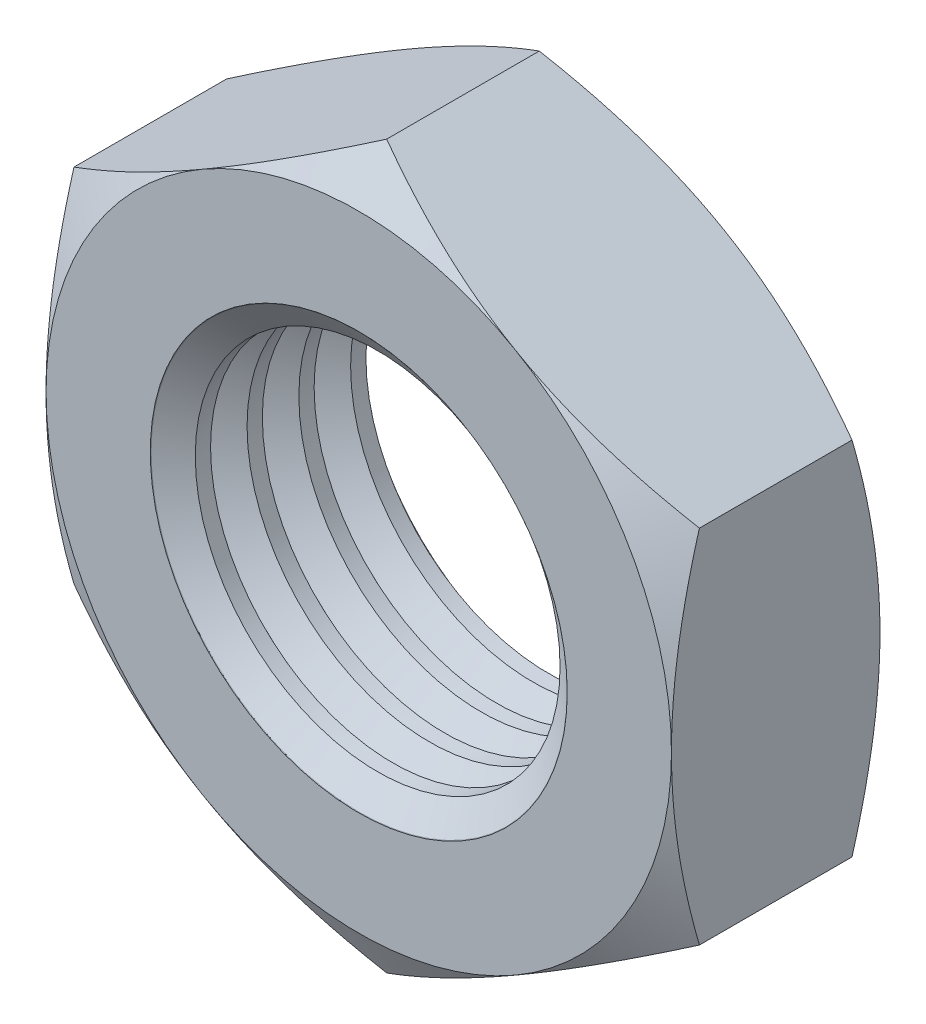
ISO-10303-21;
HEADER;
FILE_DESCRIPTION(('STEP AP214'),'2;1');
FILE_NAME('part.step','',(''),(''),'','','');
FILE_SCHEMA(('AUTOMOTIVE_DESIGN { 1 0 10303 214 1 1 1 1 }'));
ENDSEC;
DATA;
#1=APPLICATION_CONTEXT('core data for automotive mechanical design processes');
#2=APPLICATION_PROTOCOL_DEFINITION('international standard','automotive_design',2000,#1);
#3=PRODUCT_CONTEXT('',#1,'mechanical');
#4=PRODUCT('Part','Part','',(#3));
#5=PRODUCT_RELATED_PRODUCT_CATEGORY('part','',(#4));
#6=PRODUCT_DEFINITION_FORMATION('','',#4);
#7=PRODUCT_DEFINITION_CONTEXT('part definition',#1,'design');
#8=PRODUCT_DEFINITION('design','',#6,#7);
#9=PRODUCT_DEFINITION_SHAPE('','',#8);
#10=(LENGTH_UNIT() NAMED_UNIT(*) SI_UNIT(.MILLI.,.METRE.));
#11=(NAMED_UNIT(*) PLANE_ANGLE_UNIT() SI_UNIT($,.RADIAN.));
#12=(NAMED_UNIT(*) SI_UNIT($,.STERADIAN.) SOLID_ANGLE_UNIT());
#13=UNCERTAINTY_MEASURE_WITH_UNIT(LENGTH_MEASURE(1.E-05),#10,'distance_accuracy_value','');
#14=(GEOMETRIC_REPRESENTATION_CONTEXT(3) GLOBAL_UNCERTAINTY_ASSIGNED_CONTEXT((#13)) GLOBAL_UNIT_ASSIGNED_CONTEXT((#10,
#11,#12)) REPRESENTATION_CONTEXT('',''));
#15=CARTESIAN_POINT('',(0.,0.,0.));
#16=DIRECTION('',(0.,0.,1.));
#17=DIRECTION('',(1.,0.,0.));
#18=AXIS2_PLACEMENT_3D('',#15,#16,#17);
#19=CARTESIAN_POINT('',(0.,0.,-8.));
#20=DIRECTION('',(0.,0.,1.));
#21=DIRECTION('',(1.,0.,0.));
#22=AXIS2_PLACEMENT_3D('',#19,#20,#21);
#23=CYLINDRICAL_SURFACE('',#22,7.);
#24=CARTESIAN_POINT('',(0.,0.,-6.68750753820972));
#25=DIRECTION('',(0.,0.,-1.));
#26=DIRECTION('',(-1.,0.,0.));
#27=AXIS2_PLACEMENT_3D('',#24,#25,#26);
#28=CIRCLE('',#27,7.);
#29=CARTESIAN_POINT('',(-7.,0.,-6.68750753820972));
#30=VERTEX_POINT('',#29);
#31=EDGE_CURVE('E343',#30,#30,#28,.T.);
#32=ORIENTED_EDGE('',*,*,#31,.F.);
#33=EDGE_LOOP('',(#32));
#34=FACE_BOUND('',#33,.T.);
#35=CARTESIAN_POINT('',(0.,0.,-7.27439246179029));
#36=DIRECTION('',(0.,0.,-1.));
#37=DIRECTION('',(-1.,0.,0.));
#38=AXIS2_PLACEMENT_3D('',#35,#36,#37);
#39=CIRCLE('',#38,7.);
#40=CARTESIAN_POINT('',(-7.,0.,-7.27439246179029));
#41=VERTEX_POINT('',#40);
#42=EDGE_CURVE('E173',#41,#41,#39,.F.);
#43=ORIENTED_EDGE('',*,*,#42,.F.);
#44=EDGE_LOOP('',(#43));
#45=FACE_BOUND('',#44,.T.);
#46=ADVANCED_FACE('F31',(#34,#45),#23,.F.);
#47=CARTESIAN_POINT('',(0.,0.,-5.2870924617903));
#48=DIRECTION('',(0.,0.,-1.));
#49=DIRECTION('',(-1.,0.,0.));
#50=AXIS2_PLACEMENT_3D('',#47,#48,#49);
#51=CIRCLE('',#50,7.);
#52=CARTESIAN_POINT('',(-7.,0.,-5.2870924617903));
#53=VERTEX_POINT('',#52);
#54=EDGE_CURVE('E346',#53,#53,#51,.T.);
#55=ORIENTED_EDGE('',*,*,#54,.T.);
#56=EDGE_LOOP('',(#55));
#57=FACE_BOUND('',#56,.T.);
#58=CARTESIAN_POINT('',(0.,0.,-4.70020753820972));
#59=DIRECTION('',(0.,0.,-1.));
#60=DIRECTION('',(-1.,0.,0.));
#61=AXIS2_PLACEMENT_3D('',#58,#59,#60);
#62=CIRCLE('',#61,7.);
#63=CARTESIAN_POINT('',(-7.,0.,-4.70020753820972));
#64=VERTEX_POINT('',#63);
#65=EDGE_CURVE('E334',#64,#64,#62,.T.);
#66=ORIENTED_EDGE('',*,*,#65,.F.);
#67=EDGE_LOOP('',(#66));
#68=FACE_BOUND('',#67,.T.);
#69=ADVANCED_FACE('F293',(#57,#68),#23,.F.);
#70=CARTESIAN_POINT('',(0.,0.,-3.2997924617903));
#71=DIRECTION('',(0.,0.,-1.));
#72=DIRECTION('',(-1.,0.,0.));
#73=AXIS2_PLACEMENT_3D('',#70,#71,#72);
#74=CIRCLE('',#73,7.);
#75=CARTESIAN_POINT('',(-7.,0.,-3.2997924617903));
#76=VERTEX_POINT('',#75);
#77=EDGE_CURVE('E337',#76,#76,#74,.T.);
#78=ORIENTED_EDGE('',*,*,#77,.T.);
#79=EDGE_LOOP('',(#78));
#80=FACE_BOUND('',#79,.T.);
#81=CARTESIAN_POINT('',(0.,0.,-2.71290753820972));
#82=DIRECTION('',(0.,0.,-1.));
#83=DIRECTION('',(-1.,0.,0.));
#84=AXIS2_PLACEMENT_3D('',#81,#82,#83);
#85=CIRCLE('',#84,7.);
#86=CARTESIAN_POINT('',(-7.,0.,-2.71290753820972));
#87=VERTEX_POINT('',#86);
#88=EDGE_CURVE('E325',#87,#87,#85,.T.);
#89=ORIENTED_EDGE('',*,*,#88,.F.);
#90=EDGE_LOOP('',(#89));
#91=FACE_BOUND('',#90,.T.);
#92=ADVANCED_FACE('F299',(#80,#91),#23,.F.);
#93=CARTESIAN_POINT('',(0.,0.,-1.3124924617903));
#94=DIRECTION('',(0.,0.,-1.));
#95=DIRECTION('',(-1.,0.,0.));
#96=AXIS2_PLACEMENT_3D('',#93,#94,#95);
#97=CIRCLE('',#96,7.);
#98=CARTESIAN_POINT('',(-7.,0.,-1.3124924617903));
#99=VERTEX_POINT('',#98);
#100=EDGE_CURVE('E315',#99,#99,#97,.T.);
#101=ORIENTED_EDGE('',*,*,#100,.T.);
#102=EDGE_LOOP('',(#101));
#103=FACE_BOUND('',#102,.T.);
#104=CARTESIAN_POINT('',(0.,0.,-0.725607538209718));
#105=DIRECTION('',(0.,0.,-1.));
#106=DIRECTION('',(-1.,0.,0.));
#107=AXIS2_PLACEMENT_3D('',#104,#105,#106);
#108=CIRCLE('',#107,7.);
#109=CARTESIAN_POINT('',(-7.,0.,-0.725607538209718));
#110=VERTEX_POINT('',#109);
#111=EDGE_CURVE('E318',#110,#110,#108,.T.);
#112=ORIENTED_EDGE('',*,*,#111,.F.);
#113=EDGE_LOOP('',(#112));
#114=FACE_BOUND('',#113,.T.);
#115=ADVANCED_FACE('F295',(#103,#114),#23,.F.);
#116=CARTESIAN_POINT('',(0.,13.856406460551,-8.));
#117=DIRECTION('',(0.,0.,-1.));
#118=DIRECTION('',(-1.,0.,0.));
#119=AXIS2_PLACEMENT_3D('',#116,#117,#118);
#120=PLANE('',#119);
#121=CARTESIAN_POINT('',(0.,0.,-8.));
#122=DIRECTION('',(0.,0.,-1.));
#123=DIRECTION('',(-1.,0.,0.));
#124=AXIS2_PLACEMENT_3D('',#121,#122,#123);
#125=CIRCLE('',#124,12.);
#126=CARTESIAN_POINT('',(-12.,0.,-8.));
#127=VERTEX_POINT('',#126);
#128=CARTESIAN_POINT('',(-6.00000000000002,-10.3923048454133,-8.));
#129=VERTEX_POINT('',#128);
#130=EDGE_CURVE('E167',#127,#129,#125,.F.);
#131=ORIENTED_EDGE('',*,*,#130,.F.);
#132=CARTESIAN_POINT('',(-6.00000000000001,10.3923048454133,-8.));
#133=VERTEX_POINT('',#132);
#134=EDGE_CURVE('E149',#133,#127,#125,.F.);
#135=ORIENTED_EDGE('',*,*,#134,.F.);
#136=CARTESIAN_POINT('',(6.00000000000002,10.3923048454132,-8.));
#137=VERTEX_POINT('',#136);
#138=EDGE_CURVE('E166',#137,#133,#125,.F.);
#139=ORIENTED_EDGE('',*,*,#138,.F.);
#140=CARTESIAN_POINT('',(0.,0.,-8.));
#141=DIRECTION('',(0.,0.,1.));
#142=DIRECTION('',(1.,0.,0.));
#143=AXIS2_PLACEMENT_3D('',#140,#141,#142);
#144=CIRCLE('',#143,12.);
#145=CARTESIAN_POINT('',(12.,0.,-8.));
#146=VERTEX_POINT('',#145);
#147=EDGE_CURVE('E240',#146,#137,#144,.T.);
#148=ORIENTED_EDGE('',*,*,#147,.F.);
#149=CARTESIAN_POINT('',(6.00000000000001,-10.3923048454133,-8.));
#150=VERTEX_POINT('',#149);
#151=EDGE_CURVE('E464',#150,#146,#125,.F.);
#152=ORIENTED_EDGE('',*,*,#151,.F.);
#153=EDGE_CURVE('E485',#129,#150,#125,.F.);
#154=ORIENTED_EDGE('',*,*,#153,.F.);
#155=EDGE_LOOP('',(#131,#135,#139,#148,#152,#154));
#156=FACE_BOUND('',#155,.T.);
#157=CARTESIAN_POINT('',(0.,0.,-8.));
#158=DIRECTION('',(0.,0.,-1.));
#159=DIRECTION('',(-1.,0.,0.));
#160=AXIS2_PLACEMENT_3D('',#157,#158,#159);
#161=CIRCLE('',#160,8.);
#162=CARTESIAN_POINT('',(-8.,0.,-8.));
#163=VERTEX_POINT('',#162);
#164=EDGE_CURVE('E171',#163,#163,#161,.F.);
#165=ORIENTED_EDGE('',*,*,#164,.T.);
#166=EDGE_LOOP('',(#165));
#167=FACE_BOUND('',#166,.T.);
#168=ADVANCED_FACE('F245',(#156,#167),#120,.T.);
#169=CARTESIAN_POINT('',(0.,13.856406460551,0.));
#170=DIRECTION('',(0.,0.,-1.));
#171=DIRECTION('',(-1.,0.,0.));
#172=AXIS2_PLACEMENT_3D('',#169,#170,#171);
#173=PLANE('',#172);
#174=CARTESIAN_POINT('',(0.,0.,0.));
#175=DIRECTION('',(0.,0.,-1.));
#176=DIRECTION('',(-1.,0.,0.));
#177=AXIS2_PLACEMENT_3D('',#174,#175,#176);
#178=CIRCLE('',#177,12.);
#179=CARTESIAN_POINT('',(-12.,0.,0.));
#180=VERTEX_POINT('',#179);
#181=CARTESIAN_POINT('',(-6.00000000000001,10.3923048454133,0.));
#182=VERTEX_POINT('',#181);
#183=EDGE_CURVE('E11',#180,#182,#178,.T.);
#184=ORIENTED_EDGE('',*,*,#183,.F.);
#185=CARTESIAN_POINT('',(-6.00000000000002,-10.3923048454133,0.));
#186=VERTEX_POINT('',#185);
#187=EDGE_CURVE('E43',#186,#180,#178,.T.);
#188=ORIENTED_EDGE('',*,*,#187,.F.);
#189=CARTESIAN_POINT('',(6.00000000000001,-10.3923048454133,0.));
#190=VERTEX_POINT('',#189);
#191=EDGE_CURVE('E170',#190,#186,#178,.T.);
#192=ORIENTED_EDGE('',*,*,#191,.F.);
#193=CARTESIAN_POINT('',(12.,0.,0.));
#194=VERTEX_POINT('',#193);
#195=EDGE_CURVE('E422',#194,#190,#178,.T.);
#196=ORIENTED_EDGE('',*,*,#195,.F.);
#197=CARTESIAN_POINT('',(0.,0.,0.));
#198=DIRECTION('',(0.,0.,1.));
#199=DIRECTION('',(1.,0.,0.));
#200=AXIS2_PLACEMENT_3D('',#197,#198,#199);
#201=CIRCLE('',#200,12.);
#202=CARTESIAN_POINT('',(6.00000000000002,10.3923048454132,0.));
#203=VERTEX_POINT('',#202);
#204=EDGE_CURVE('E125',#194,#203,#201,.T.);
#205=ORIENTED_EDGE('',*,*,#204,.T.);
#206=EDGE_CURVE('E41',#182,#203,#178,.T.);
#207=ORIENTED_EDGE('',*,*,#206,.F.);
#208=EDGE_LOOP('',(#184,#188,#192,#196,#205,#207));
#209=FACE_BOUND('',#208,.T.);
#210=CARTESIAN_POINT('',(0.,0.,0.));
#211=DIRECTION('',(0.,0.,1.));
#212=DIRECTION('',(1.,0.,0.));
#213=AXIS2_PLACEMENT_3D('',#210,#211,#212);
#214=CIRCLE('',#213,8.);
#215=CARTESIAN_POINT('',(8.,0.,0.));
#216=VERTEX_POINT('',#215);
#217=EDGE_CURVE('E176',#216,#216,#214,.T.);
#218=ORIENTED_EDGE('',*,*,#217,.F.);
#219=EDGE_LOOP('',(#218));
#220=FACE_BOUND('',#219,.T.);
#221=ADVANCED_FACE('F309',(#209,#220),#173,.F.);
#222=CARTESIAN_POINT('',(0.,13.856406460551,-8.));
#223=DIRECTION('',(-0.500000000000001,0.866025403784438,0.));
#224=DIRECTION('',(-0.866025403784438,-0.500000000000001,0.));
#225=AXIS2_PLACEMENT_3D('',#222,#223,#224);
#226=PLANE('',#225);
#227=DIRECTION('',(0.,0.,1.));
#228=VECTOR('',#227,1.);
#229=CARTESIAN_POINT('',(-12.,6.9282032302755,-8.));
#230=LINE('',#229,#228);
#231=CARTESIAN_POINT('',(-12.,6.92820323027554,-6.9282032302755));
#232=VERTEX_POINT('',#231);
#233=CARTESIAN_POINT('',(-12.,6.9282032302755,-1.07179676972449));
#234=VERTEX_POINT('',#233);
#235=EDGE_CURVE('E161',#232,#234,#230,.T.);
#236=ORIENTED_EDGE('',*,*,#235,.T.);
#237=CARTESIAN_POINT('',(-12.0002,6.92808776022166,-1.07186343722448));
#238=CARTESIAN_POINT('',(-11.7364142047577,7.08038456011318,-0.983949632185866));
#239=CARTESIAN_POINT('',(-11.4716448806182,7.2332492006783,-0.900025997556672));
#240=CARTESIAN_POINT('',(-10.9399829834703,7.54020434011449,-0.741266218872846));
#241=CARTESIAN_POINT('',(-10.6730897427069,7.69429522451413,-0.666433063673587));
#242=CARTESIAN_POINT('',(-9.86810959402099,8.15905073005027,-0.457017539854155));
#243=CARTESIAN_POINT('',(-9.3268449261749,8.47155003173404,-0.337903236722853));
#244=CARTESIAN_POINT('',(-8.51686717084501,8.93919090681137,-0.198231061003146));
#245=CARTESIAN_POINT('',(-8.25057389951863,9.09293539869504,-0.158443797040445));
#246=CARTESIAN_POINT('',(-7.71675440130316,9.40113622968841,-0.0917233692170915));
#247=CARTESIAN_POINT('',(-7.44922815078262,9.55559258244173,-0.0647904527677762));
#248=CARTESIAN_POINT('',(-6.91372963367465,9.86476279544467,-0.0244685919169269));
#249=CARTESIAN_POINT('',(-6.64575827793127,10.0194761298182,-0.011063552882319));
#250=CARTESIAN_POINT('',(-6.10956726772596,10.3290461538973,0.00191690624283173));
#251=CARTESIAN_POINT('',(-5.84134762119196,10.4839028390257,0.00149275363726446));
#252=CARTESIAN_POINT('',(-5.3399106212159,10.7734076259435,-0.012220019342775));
#253=CARTESIAN_POINT('',(-5.10665750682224,10.908076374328,-0.0238359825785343));
#254=CARTESIAN_POINT('',(-4.64068775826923,11.1771041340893,-0.0573080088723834));
#255=CARTESIAN_POINT('',(-4.40797116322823,11.3114631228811,-0.0791647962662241));
#256=CARTESIAN_POINT('',(-3.94320092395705,11.5797983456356,-0.132737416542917));
#257=CARTESIAN_POINT('',(-3.71114798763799,11.7137741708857,-0.164461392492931));
#258=CARTESIAN_POINT('',(-3.24813003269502,11.9810977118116,-0.237211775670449));
#259=CARTESIAN_POINT('',(-3.01716508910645,12.1144453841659,-0.278238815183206));
#260=CARTESIAN_POINT('',(-2.31605804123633,12.5192297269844,-0.416311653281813));
#261=CARTESIAN_POINT('',(-1.84794625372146,12.789494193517,-0.527124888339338));
#262=CARTESIAN_POINT('',(-0.918702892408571,13.3259930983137,-0.778625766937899));
#263=CARTESIAN_POINT('',(-0.457559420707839,13.5922344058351,-0.9192543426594));
#264=CARTESIAN_POINT('',(0.000200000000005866,13.8565219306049,-1.07186343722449));
#265=B_SPLINE_CURVE_WITH_KNOTS('',3,(#237,#238,#239,#240,#241,#242,#243,#244,#245,#246,#247,
#248,#249,#250,#251,#252,#253,#254,#255,#256,#257,#258,#259,#260,#261,#262,#263,#264),
.UNSPECIFIED.,.F.,.F.,(4,2,2,2,2,2,2,2,2,2,2,2,2,4),(0.,0.951004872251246,1.90232158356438,
3.80900466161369,4.73894551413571,5.6689042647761,6.59775529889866,7.52657763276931,
8.3351464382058,9.1437724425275,9.95306755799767,10.7624176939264,12.4167102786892,
14.0677556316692),.UNSPECIFIED.);
#266=EDGE_CURVE('E130',#234,#182,#265,.T.);
#267=ORIENTED_EDGE('',*,*,#266,.T.);
#268=CARTESIAN_POINT('',(0.,13.856406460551,-1.0717967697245));
#269=VERTEX_POINT('',#268);
#270=EDGE_CURVE('E50',#182,#269,#265,.T.);
#271=ORIENTED_EDGE('',*,*,#270,.T.);
#272=DIRECTION('',(0.,0.,1.));
#273=VECTOR('',#272,1.);
#274=CARTESIAN_POINT('',(0.,13.856406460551,-8.));
#275=LINE('',#274,#273);
#276=CARTESIAN_POINT('',(0.,13.856406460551,-6.9282032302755));
#277=VERTEX_POINT('',#276);
#278=EDGE_CURVE('E146',#277,#269,#275,.T.);
#279=ORIENTED_EDGE('',*,*,#278,.F.);
#280=CARTESIAN_POINT('',(-12.0002,6.92808776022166,-6.92813656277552));
#281=CARTESIAN_POINT('',(-11.7364142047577,7.08038456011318,-7.01605036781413));
#282=CARTESIAN_POINT('',(-11.4716448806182,7.2332492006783,-7.09997400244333));
#283=CARTESIAN_POINT('',(-10.9399829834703,7.54020434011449,-7.25873378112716));
#284=CARTESIAN_POINT('',(-10.6730897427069,7.69429522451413,-7.33356693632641));
#285=CARTESIAN_POINT('',(-9.86810959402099,8.15905073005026,-7.54298246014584));
#286=CARTESIAN_POINT('',(-9.3268449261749,8.47155003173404,-7.66209676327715));
#287=CARTESIAN_POINT('',(-8.51686717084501,8.93919090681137,-7.80176893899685));
#288=CARTESIAN_POINT('',(-8.25057389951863,9.09293539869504,-7.84155620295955));
#289=CARTESIAN_POINT('',(-7.71675440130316,9.40113622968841,-7.90827663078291));
#290=CARTESIAN_POINT('',(-7.44922815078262,9.55559258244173,-7.93520954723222));
#291=CARTESIAN_POINT('',(-6.91372963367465,9.86476279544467,-7.97553140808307));
#292=CARTESIAN_POINT('',(-6.64575827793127,10.0194761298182,-7.98893644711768));
#293=CARTESIAN_POINT('',(-6.10956726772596,10.3290461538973,-8.00191690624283));
#294=CARTESIAN_POINT('',(-5.84134762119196,10.4839028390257,-8.00149275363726));
#295=CARTESIAN_POINT('',(-5.33991062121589,10.7734076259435,-7.98777998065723));
#296=CARTESIAN_POINT('',(-5.10665750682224,10.908076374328,-7.97616401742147));
#297=CARTESIAN_POINT('',(-4.64068775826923,11.1771041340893,-7.94269199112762));
#298=CARTESIAN_POINT('',(-4.40797116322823,11.3114631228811,-7.92083520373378));
#299=CARTESIAN_POINT('',(-3.94320092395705,11.5797983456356,-7.86726258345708));
#300=CARTESIAN_POINT('',(-3.71114798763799,11.7137741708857,-7.83553860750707));
#301=CARTESIAN_POINT('',(-3.24813003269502,11.9810977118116,-7.76278822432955));
#302=CARTESIAN_POINT('',(-3.01716508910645,12.1144453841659,-7.72176118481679));
#303=CARTESIAN_POINT('',(-2.31605804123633,12.5192297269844,-7.58368834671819));
#304=CARTESIAN_POINT('',(-1.84794625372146,12.789494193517,-7.47287511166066));
#305=CARTESIAN_POINT('',(-0.918702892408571,13.3259930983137,-7.2213742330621));
#306=CARTESIAN_POINT('',(-0.457559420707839,13.5922344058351,-7.0807456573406));
#307=CARTESIAN_POINT('',(0.000200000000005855,13.8565219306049,-6.92813656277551));
#308=B_SPLINE_CURVE_WITH_KNOTS('',3,(#280,#281,#282,#283,#284,#285,#286,#287,#288,#289,#290,
#291,#292,#293,#294,#295,#296,#297,#298,#299,#300,#301,#302,#303,#304,#305,#306,#307),
.UNSPECIFIED.,.F.,.F.,(4,2,2,2,2,2,2,2,2,2,2,2,2,4),(0.,0.951004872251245,1.90232158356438,
3.80900466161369,4.7389455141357,5.6689042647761,6.59775529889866,7.52657763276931,
8.3351464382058,9.1437724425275,9.95306755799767,10.7624176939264,12.4167102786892,
14.0677556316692),.UNSPECIFIED.);
#309=EDGE_CURVE('E164',#133,#277,#308,.T.);
#310=ORIENTED_EDGE('',*,*,#309,.F.);
#311=EDGE_CURVE('E255',#232,#133,#308,.T.);
#312=ORIENTED_EDGE('',*,*,#311,.F.);
#313=EDGE_LOOP('',(#236,#267,#271,#279,#310,#312));
#314=FACE_BOUND('',#313,.T.);
#315=ADVANCED_FACE('F33',(#314),#226,.T.);
#316=CARTESIAN_POINT('',(12.,6.92820323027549,-8.));
#317=DIRECTION('',(0.500000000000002,0.866025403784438,0.));
#318=DIRECTION('',(-0.866025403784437,0.500000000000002,0.));
#319=AXIS2_PLACEMENT_3D('',#316,#317,#318);
#320=PLANE('',#319);
#321=ORIENTED_EDGE('',*,*,#278,.T.);
#322=CARTESIAN_POINT('',(-0.000199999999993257,13.8565219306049,-1.07186343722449));
#323=CARTESIAN_POINT('',(0.263585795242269,13.7042251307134,-0.983949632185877));
#324=CARTESIAN_POINT('',(0.528355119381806,13.5513604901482,-0.900025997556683));
#325=CARTESIAN_POINT('',(1.06001701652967,13.244405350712,-0.741266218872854));
#326=CARTESIAN_POINT('',(1.32691025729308,13.0903144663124,-0.666433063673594));
#327=CARTESIAN_POINT('',(2.13189040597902,12.6255589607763,-0.45701753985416));
#328=CARTESIAN_POINT('',(2.67315507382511,12.3130596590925,-0.337903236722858));
#329=CARTESIAN_POINT('',(3.48313282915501,11.8454187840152,-0.19823106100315));
#330=CARTESIAN_POINT('',(3.74942610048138,11.6916742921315,-0.158443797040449));
#331=CARTESIAN_POINT('',(4.28324559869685,11.3834734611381,-0.0917233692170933));
#332=CARTESIAN_POINT('',(4.55077184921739,11.2290171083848,-0.0647904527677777));
#333=CARTESIAN_POINT('',(5.08627036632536,10.9198468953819,-0.0244685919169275));
#334=CARTESIAN_POINT('',(5.35424172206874,10.7651335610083,-0.011063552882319));
#335=CARTESIAN_POINT('',(5.89043273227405,10.4555635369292,0.00191690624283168));
#336=CARTESIAN_POINT('',(6.15865237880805,10.3007068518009,0.00149275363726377));
#337=CARTESIAN_POINT('',(6.66008937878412,10.011202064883,-0.0122200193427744));
#338=CARTESIAN_POINT('',(6.89334249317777,9.87653331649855,-0.0238359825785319));
#339=CARTESIAN_POINT('',(7.35931224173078,9.60750555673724,-0.0573080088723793));
#340=CARTESIAN_POINT('',(7.59202883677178,9.47314656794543,-0.0791647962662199));
#341=CARTESIAN_POINT('',(8.05679907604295,9.20481134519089,-0.132737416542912));
#342=CARTESIAN_POINT('',(8.28885201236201,9.07083551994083,-0.164461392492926));
#343=CARTESIAN_POINT('',(8.75186996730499,8.80351197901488,-0.237211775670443));
#344=CARTESIAN_POINT('',(8.98283491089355,8.67016430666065,-0.278238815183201));
#345=CARTESIAN_POINT('',(9.68394195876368,8.26537996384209,-0.416311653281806));
#346=CARTESIAN_POINT('',(10.1520537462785,7.99511549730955,-0.52712488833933));
#347=CARTESIAN_POINT('',(11.0812971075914,7.45861659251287,-0.778625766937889));
#348=CARTESIAN_POINT('',(11.5424405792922,7.19237528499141,-0.919254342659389));
#349=CARTESIAN_POINT('',(12.0002,6.92808776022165,-1.07186343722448));
#350=B_SPLINE_CURVE_WITH_KNOTS('',3,(#322,#323,#324,#325,#326,#327,#328,#329,#330,#331,#332,
#333,#334,#335,#336,#337,#338,#339,#340,#341,#342,#343,#344,#345,#346,#347,#348,#349),
.UNSPECIFIED.,.F.,.F.,(4,2,2,2,2,2,2,2,2,2,2,2,2,4),(0.,0.951004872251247,1.90232158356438,
3.8090046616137,4.73894551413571,5.66890426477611,6.59775529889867,7.52657763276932,
8.3351464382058,9.14377244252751,9.95306755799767,10.7624176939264,12.4167102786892,
14.0677556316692),.UNSPECIFIED.);
#351=EDGE_CURVE('E140',#269,#203,#350,.T.);
#352=ORIENTED_EDGE('',*,*,#351,.T.);
#353=CARTESIAN_POINT('',(12.,6.92820323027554,-1.0717967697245));
#354=VERTEX_POINT('',#353);
#355=EDGE_CURVE('E57',#203,#354,#350,.T.);
#356=ORIENTED_EDGE('',*,*,#355,.T.);
#357=DIRECTION('',(0.,0.,1.));
#358=VECTOR('',#357,1.);
#359=CARTESIAN_POINT('',(12.,6.92820323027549,-8.));
#360=LINE('',#359,#358);
#361=CARTESIAN_POINT('',(12.,6.92820323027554,-6.9282032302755));
#362=VERTEX_POINT('',#361);
#363=EDGE_CURVE('E139',#362,#354,#360,.T.);
#364=ORIENTED_EDGE('',*,*,#363,.F.);
#365=CARTESIAN_POINT('',(-0.000199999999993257,13.8565219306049,-6.92813656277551));
#366=CARTESIAN_POINT('',(0.263585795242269,13.7042251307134,-7.01605036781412));
#367=CARTESIAN_POINT('',(0.528355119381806,13.5513604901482,-7.09997400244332));
#368=CARTESIAN_POINT('',(1.06001701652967,13.244405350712,-7.25873378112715));
#369=CARTESIAN_POINT('',(1.32691025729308,13.0903144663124,-7.33356693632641));
#370=CARTESIAN_POINT('',(2.13189040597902,12.6255589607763,-7.54298246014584));
#371=CARTESIAN_POINT('',(2.67315507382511,12.3130596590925,-7.66209676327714));
#372=CARTESIAN_POINT('',(3.48313282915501,11.8454187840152,-7.80176893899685));
#373=CARTESIAN_POINT('',(3.74942610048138,11.6916742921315,-7.84155620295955));
#374=CARTESIAN_POINT('',(4.28324559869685,11.3834734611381,-7.90827663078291));
#375=CARTESIAN_POINT('',(4.55077184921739,11.2290171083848,-7.93520954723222));
#376=CARTESIAN_POINT('',(5.08627036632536,10.9198468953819,-7.97553140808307));
#377=CARTESIAN_POINT('',(5.35424172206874,10.7651335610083,-7.98893644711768));
#378=CARTESIAN_POINT('',(5.89043273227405,10.4555635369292,-8.00191690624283));
#379=CARTESIAN_POINT('',(6.15865237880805,10.3007068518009,-8.00149275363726));
#380=CARTESIAN_POINT('',(6.66008937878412,10.011202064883,-7.98777998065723));
#381=CARTESIAN_POINT('',(6.89334249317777,9.87653331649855,-7.97616401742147));
#382=CARTESIAN_POINT('',(7.35931224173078,9.60750555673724,-7.94269199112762));
#383=CARTESIAN_POINT('',(7.59202883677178,9.47314656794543,-7.92083520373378));
#384=CARTESIAN_POINT('',(8.05679907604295,9.20481134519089,-7.86726258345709));
#385=CARTESIAN_POINT('',(8.28885201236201,9.07083551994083,-7.83553860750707));
#386=CARTESIAN_POINT('',(8.75186996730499,8.80351197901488,-7.76278822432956));
#387=CARTESIAN_POINT('',(8.98283491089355,8.67016430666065,-7.7217611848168));
#388=CARTESIAN_POINT('',(9.68394195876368,8.26537996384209,-7.58368834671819));
#389=CARTESIAN_POINT('',(10.1520537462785,7.99511549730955,-7.47287511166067));
#390=CARTESIAN_POINT('',(11.0812971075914,7.45861659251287,-7.22137423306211));
#391=CARTESIAN_POINT('',(11.5424405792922,7.19237528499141,-7.08074565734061));
#392=CARTESIAN_POINT('',(12.0002,6.92808776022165,-6.92813656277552));
#393=B_SPLINE_CURVE_WITH_KNOTS('',3,(#365,#366,#367,#368,#369,#370,#371,#372,#373,#374,#375,
#376,#377,#378,#379,#380,#381,#382,#383,#384,#385,#386,#387,#388,#389,#390,#391,#392),
.UNSPECIFIED.,.F.,.F.,(4,2,2,2,2,2,2,2,2,2,2,2,2,4),(0.,0.951004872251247,1.90232158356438,
3.8090046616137,4.73894551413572,5.66890426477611,6.59775529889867,7.52657763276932,
8.3351464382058,9.14377244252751,9.95306755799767,10.7624176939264,12.4167102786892,
14.0677556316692),.UNSPECIFIED.);
#394=EDGE_CURVE('E249',#137,#362,#393,.T.);
#395=ORIENTED_EDGE('',*,*,#394,.F.);
#396=EDGE_CURVE('E254',#277,#137,#393,.T.);
#397=ORIENTED_EDGE('',*,*,#396,.F.);
#398=EDGE_LOOP('',(#321,#352,#356,#364,#395,#397));
#399=FACE_BOUND('',#398,.T.);
#400=ADVANCED_FACE('F137',(#399),#320,.T.);
#401=CARTESIAN_POINT('',(12.,6.92820323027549,-8.));
#402=DIRECTION('',(-1.,0.,0.));
#403=DIRECTION('',(0.,0.,1.));
#404=AXIS2_PLACEMENT_3D('',#401,#402,#403);
#405=PLANE('',#404);
#406=CARTESIAN_POINT('',(12.,-18.3746159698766,-5.74232046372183));
#407=CARTESIAN_POINT('',(12.,-18.1111918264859,-5.61498513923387));
#408=CARTESIAN_POINT('',(12.,-17.8474492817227,-5.48830883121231));
#409=CARTESIAN_POINT('',(12.,-17.3192601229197,-5.23642551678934));
#410=CARTESIAN_POINT('',(12.,-17.0548135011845,-5.11121852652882));
#411=CARTESIAN_POINT('',(12.,-16.2602391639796,-4.73799215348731));
#412=CARTESIAN_POINT('',(12.,-15.7289626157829,-4.49240888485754));
#413=CARTESIAN_POINT('',(12.,-14.659698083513,-4.00791887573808));
#414=CARTESIAN_POINT('',(12.,-14.1216890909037,-3.76905838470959));
#415=CARTESIAN_POINT('',(12.,-13.0412497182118,-3.30159295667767));
#416=CARTESIAN_POINT('',(12.,-12.4988195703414,-3.07298748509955));
#417=CARTESIAN_POINT('',(12.,-11.4019415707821,-2.62605165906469));
#418=CARTESIAN_POINT('',(12.,-10.8474279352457,-2.407881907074));
#419=CARTESIAN_POINT('',(12.,-9.73185625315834,-1.98862863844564));
#420=CARTESIAN_POINT('',(12.,-9.17079748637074,-1.78754702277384));
#421=CARTESIAN_POINT('',(12.,-8.04241377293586,-1.40787575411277));
#422=CARTESIAN_POINT('',(12.,-7.4751050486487,-1.22923828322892));
#423=CARTESIAN_POINT('',(12.,-6.33236790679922,-0.900248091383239));
#424=CARTESIAN_POINT('',(12.,-5.75694211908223,-0.74988642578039));
#425=CARTESIAN_POINT('',(12.,-4.88760620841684,-0.55105505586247));
#426=CARTESIAN_POINT('',(12.,-4.59673300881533,-0.489219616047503));
#427=CARTESIAN_POINT('',(12.,-4.01305048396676,-0.375428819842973));
#428=CARTESIAN_POINT('',(12.,-3.72024120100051,-0.323473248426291));
#429=CARTESIAN_POINT('',(12.,-3.13287727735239,-0.230362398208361));
#430=CARTESIAN_POINT('',(12.,-2.83832249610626,-0.18920800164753));
#431=CARTESIAN_POINT('',(12.,-2.24782315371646,-0.118528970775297));
#432=CARTESIAN_POINT('',(12.,-1.9518786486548,-0.0890038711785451));
#433=CARTESIAN_POINT('',(12.,-1.36089234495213,-0.0423753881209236));
#434=CARTESIAN_POINT('',(12.,-1.06585670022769,-0.025194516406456));
#435=CARTESIAN_POINT('',(12.,-0.475323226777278,-0.00334573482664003));
#436=CARTESIAN_POINT('',(12.,-0.1798254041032,0.00132233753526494));
#437=CARTESIAN_POINT('',(12.,0.411018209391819,-0.00196522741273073));
#438=CARTESIAN_POINT('',(12.,0.706364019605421,-0.00991732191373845));
#439=CARTESIAN_POINT('',(12.,1.29646300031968,-0.038247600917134));
#440=CARTESIAN_POINT('',(12.,1.59121614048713,-0.0586264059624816));
#441=CARTESIAN_POINT('',(12.,2.30560702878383,-0.122652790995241));
#442=CARTESIAN_POINT('',(12.,2.72469590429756,-0.172526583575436));
#443=CARTESIAN_POINT('',(12.,3.5596621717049,-0.294627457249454));
#444=CARTESIAN_POINT('',(12.,3.97553865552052,-0.366860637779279));
#445=CARTESIAN_POINT('',(12.,4.80373712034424,-0.531118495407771));
#446=CARTESIAN_POINT('',(12.,5.21605535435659,-0.623161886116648));
#447=CARTESIAN_POINT('',(12.,6.03644960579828,-0.824231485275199));
#448=CARTESIAN_POINT('',(12.,6.44452601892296,-0.933256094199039));
#449=CARTESIAN_POINT('',(12.,7.26648771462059,-1.16853096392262));
#450=CARTESIAN_POINT('',(12.,7.68027019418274,-1.29513795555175));
#451=CARTESIAN_POINT('',(12.,8.50346065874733,-1.56085760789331));
#452=CARTESIAN_POINT('',(12.,8.91287144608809,-1.69996164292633));
#453=CARTESIAN_POINT('',(12.,9.72567950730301,-1.98781971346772));
#454=CARTESIAN_POINT('',(12.,10.1290976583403,-2.13651502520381));
#455=CARTESIAN_POINT('',(12.,10.7318330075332,-2.36605061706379));
#456=CARTESIAN_POINT('',(12.,10.9323890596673,-2.44366199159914));
#457=CARTESIAN_POINT('',(12.,11.3327210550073,-2.60085858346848));
#458=CARTESIAN_POINT('',(12.,11.5324970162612,-2.68044375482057));
#459=CARTESIAN_POINT('',(12.,11.7319109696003,-2.76092701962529));
#460=B_SPLINE_CURVE_WITH_KNOTS('',3,(#406,#407,#408,#409,#410,#411,#412,#413,#414,#415,#416,
#417,#418,#419,#420,#421,#422,#423,#424,#425,#426,#427,#428,#429,#430,#431,#432,#433,#434,#435,
#436,#437,#438,#439,#440,#441,#442,#443,#444,#445,#446,#447,#448,#449,#450,#451,#452,#453,#454,
#455,#456,#457,#458,#459),.UNSPECIFIED.,.F.,.F.,(4,2,2,2,2,2,2,2,2,2,2,2,2,2,2,2,2,2,2,2,2,2,2,
2,2,2,4),(0.,0.87775627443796,1.75552218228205,3.51133949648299,5.27720464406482,
7.04297763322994,8.83042883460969,10.6180786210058,12.4018527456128,14.1850616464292,
15.0770405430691,15.9690000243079,16.861032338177,17.7530289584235,18.63937614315,
19.5257118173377,20.4117987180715,21.2979298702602,22.5633628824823,23.8291413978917,
25.0961209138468,26.3629811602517,27.6608948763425,28.9579195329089,30.2476436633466,
30.8927835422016,31.5379084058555),.UNSPECIFIED.);
#461=CARTESIAN_POINT('',(12.,-6.92820323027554,-1.0717967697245));
#462=VERTEX_POINT('',#461);
#463=EDGE_CURVE('E132',#462,#194,#460,.T.);
#464=ORIENTED_EDGE('',*,*,#463,.F.);
#465=DIRECTION('',(0.,0.,1.));
#466=VECTOR('',#465,1.);
#467=CARTESIAN_POINT('',(12.,-6.92820323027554,-8.));
#468=LINE('',#467,#466);
#469=CARTESIAN_POINT('',(12.,-6.92820323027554,-6.9282032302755));
#470=VERTEX_POINT('',#469);
#471=EDGE_CURVE('E147',#470,#462,#468,.T.);
#472=ORIENTED_EDGE('',*,*,#471,.F.);
#473=CARTESIAN_POINT('',(12.,-18.3746159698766,-2.25767953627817));
#474=CARTESIAN_POINT('',(12.,-18.1111918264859,-2.38501486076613));
#475=CARTESIAN_POINT('',(12.,-17.8474492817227,-2.51169116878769));
#476=CARTESIAN_POINT('',(12.,-17.3192601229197,-2.76357448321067));
#477=CARTESIAN_POINT('',(12.,-17.0548135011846,-2.88878147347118));
#478=CARTESIAN_POINT('',(12.,-16.2602391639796,-3.26200784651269));
#479=CARTESIAN_POINT('',(12.,-15.7289626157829,-3.50759111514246));
#480=CARTESIAN_POINT('',(12.,-14.659698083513,-3.99208112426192));
#481=CARTESIAN_POINT('',(12.,-14.1216890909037,-4.23094161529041));
#482=CARTESIAN_POINT('',(12.,-13.0412497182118,-4.69840704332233));
#483=CARTESIAN_POINT('',(12.,-12.4988195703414,-4.92701251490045));
#484=CARTESIAN_POINT('',(12.,-11.4019415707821,-5.37394834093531));
#485=CARTESIAN_POINT('',(12.,-10.8474279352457,-5.592118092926));
#486=CARTESIAN_POINT('',(12.,-9.73185625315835,-6.01137136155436));
#487=CARTESIAN_POINT('',(12.,-9.17079748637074,-6.21245297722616));
#488=CARTESIAN_POINT('',(12.,-8.04241377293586,-6.59212424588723));
#489=CARTESIAN_POINT('',(12.,-7.4751050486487,-6.77076171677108));
#490=CARTESIAN_POINT('',(12.,-6.33236790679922,-7.09975190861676));
#491=CARTESIAN_POINT('',(12.,-5.75694211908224,-7.25011357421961));
#492=CARTESIAN_POINT('',(12.,-4.88760620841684,-7.44894494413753));
#493=CARTESIAN_POINT('',(12.,-4.59673300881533,-7.5107803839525));
#494=CARTESIAN_POINT('',(12.,-4.01305048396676,-7.62457118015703));
#495=CARTESIAN_POINT('',(12.,-3.72024120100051,-7.67652675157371));
#496=CARTESIAN_POINT('',(12.,-3.13287727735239,-7.76963760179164));
#497=CARTESIAN_POINT('',(12.,-2.83832249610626,-7.81079199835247));
#498=CARTESIAN_POINT('',(12.,-2.24782315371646,-7.8814710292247));
#499=CARTESIAN_POINT('',(12.,-1.95187864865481,-7.91099612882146));
#500=CARTESIAN_POINT('',(12.,-1.36089234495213,-7.95762461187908));
#501=CARTESIAN_POINT('',(12.,-1.0658567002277,-7.97480548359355));
#502=CARTESIAN_POINT('',(12.,-0.475323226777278,-7.99665426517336));
#503=CARTESIAN_POINT('',(12.,-0.179825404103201,-8.00132233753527));
#504=CARTESIAN_POINT('',(12.,0.411018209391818,-7.99803477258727));
#505=CARTESIAN_POINT('',(12.,0.706364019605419,-7.99008267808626));
#506=CARTESIAN_POINT('',(12.,1.29646300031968,-7.96175239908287));
#507=CARTESIAN_POINT('',(12.,1.59121614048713,-7.94137359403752));
#508=CARTESIAN_POINT('',(12.,2.30560702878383,-7.87734720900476));
#509=CARTESIAN_POINT('',(12.,2.72469590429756,-7.82747341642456));
#510=CARTESIAN_POINT('',(12.,3.55966217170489,-7.70537254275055));
#511=CARTESIAN_POINT('',(12.,3.97553865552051,-7.63313936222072));
#512=CARTESIAN_POINT('',(12.,4.80373712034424,-7.46888150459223));
#513=CARTESIAN_POINT('',(12.,5.21605535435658,-7.37683811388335));
#514=CARTESIAN_POINT('',(12.,6.03644960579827,-7.1757685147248));
#515=CARTESIAN_POINT('',(12.,6.44452601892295,-7.06674390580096));
#516=CARTESIAN_POINT('',(12.,7.26648771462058,-6.83146903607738));
#517=CARTESIAN_POINT('',(12.,7.68027019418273,-6.70486204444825));
#518=CARTESIAN_POINT('',(12.,8.50346065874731,-6.4391423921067));
#519=CARTESIAN_POINT('',(12.,8.91287144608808,-6.30003835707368));
#520=CARTESIAN_POINT('',(12.,9.725679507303,-6.01218028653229));
#521=CARTESIAN_POINT('',(12.,10.1290976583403,-5.8634849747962));
#522=CARTESIAN_POINT('',(12.,10.7318330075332,-5.63394938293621));
#523=CARTESIAN_POINT('',(12.,10.9323890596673,-5.55633800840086));
#524=CARTESIAN_POINT('',(12.,11.3327210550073,-5.39914141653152));
#525=CARTESIAN_POINT('',(12.,11.5324970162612,-5.31955624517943));
#526=CARTESIAN_POINT('',(12.,11.7319109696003,-5.23907298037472));
#527=B_SPLINE_CURVE_WITH_KNOTS('',3,(#473,#474,#475,#476,#477,#478,#479,#480,#481,#482,#483,
#484,#485,#486,#487,#488,#489,#490,#491,#492,#493,#494,#495,#496,#497,#498,#499,#500,#501,#502,
#503,#504,#505,#506,#507,#508,#509,#510,#511,#512,#513,#514,#515,#516,#517,#518,#519,#520,#521,
#522,#523,#524,#525,#526),.UNSPECIFIED.,.F.,.F.,(4,2,2,2,2,2,2,2,2,2,2,2,2,2,2,2,2,2,2,2,2,2,2,
2,2,2,4),(0.,0.877756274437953,1.75552218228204,3.51133949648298,5.27720464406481,
7.04297763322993,8.83042883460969,10.6180786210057,12.4018527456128,14.1850616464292,
15.0770405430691,15.9690000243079,16.861032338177,17.7530289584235,18.63937614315,
19.5257118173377,20.4117987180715,21.2979298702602,22.5633628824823,23.8291413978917,
25.0961209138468,26.3629811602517,27.6608948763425,28.9579195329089,30.2476436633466,
30.8927835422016,31.5379084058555),.UNSPECIFIED.);
#528=EDGE_CURVE('E261',#470,#146,#527,.T.);
#529=ORIENTED_EDGE('',*,*,#528,.T.);
#530=EDGE_CURVE('E145',#146,#362,#527,.T.);
#531=ORIENTED_EDGE('',*,*,#530,.T.);
#532=ORIENTED_EDGE('',*,*,#363,.T.);
#533=EDGE_CURVE('E122',#194,#354,#460,.T.);
#534=ORIENTED_EDGE('',*,*,#533,.F.);
#535=EDGE_LOOP('',(#464,#472,#529,#531,#532,#534));
#536=FACE_BOUND('',#535,.T.);
#537=ADVANCED_FACE('F143',(#536),#405,.F.);
#538=CARTESIAN_POINT('',(0.,-13.8564064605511,-8.));
#539=DIRECTION('',(0.500000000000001,-0.866025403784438,0.));
#540=DIRECTION('',(0.866025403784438,0.500000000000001,0.));
#541=AXIS2_PLACEMENT_3D('',#538,#539,#540);
#542=PLANE('',#541);
#543=ORIENTED_EDGE('',*,*,#471,.T.);
#544=CARTESIAN_POINT('',(12.0002,-6.9280877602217,-1.0718634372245));
#545=CARTESIAN_POINT('',(11.7364142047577,-7.08038456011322,-0.983949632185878));
#546=CARTESIAN_POINT('',(11.4716448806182,-7.23324920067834,-0.900025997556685));
#547=CARTESIAN_POINT('',(10.9399829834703,-7.54020434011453,-0.741266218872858));
#548=CARTESIAN_POINT('',(10.6730897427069,-7.69429522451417,-0.6664330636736));
#549=CARTESIAN_POINT('',(9.86810959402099,-8.15905073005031,-0.457017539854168));
#550=CARTESIAN_POINT('',(9.3268449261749,-8.47155003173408,-0.337903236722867));
#551=CARTESIAN_POINT('',(8.516867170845,-8.93919090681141,-0.198231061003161));
#552=CARTESIAN_POINT('',(8.25057389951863,-9.09293539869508,-0.158443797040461));
#553=CARTESIAN_POINT('',(7.71675440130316,-9.40113622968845,-0.0917233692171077));
#554=CARTESIAN_POINT('',(7.44922815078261,-9.55559258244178,-0.0647904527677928));
#555=CARTESIAN_POINT('',(6.91372963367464,-9.86476279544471,-0.0244685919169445));
#556=CARTESIAN_POINT('',(6.64575827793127,-10.0194761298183,-0.0110635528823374));
#557=CARTESIAN_POINT('',(6.10956726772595,-10.3290461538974,0.001916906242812));
#558=CARTESIAN_POINT('',(5.84134762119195,-10.4839028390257,0.00149275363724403));
#559=CARTESIAN_POINT('',(5.33991062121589,-10.7734076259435,-0.0122200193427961));
#560=CARTESIAN_POINT('',(5.10665750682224,-10.908076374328,-0.0238359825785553));
#561=CARTESIAN_POINT('',(4.64068775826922,-11.1771041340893,-0.0573080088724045));
#562=CARTESIAN_POINT('',(4.40797116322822,-11.3114631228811,-0.0791647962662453));
#563=CARTESIAN_POINT('',(3.94320092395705,-11.5797983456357,-0.132737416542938));
#564=CARTESIAN_POINT('',(3.71114798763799,-11.7137741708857,-0.164461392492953));
#565=CARTESIAN_POINT('',(3.24813003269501,-11.9810977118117,-0.237211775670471));
#566=CARTESIAN_POINT('',(3.01716508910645,-12.1144453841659,-0.278238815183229));
#567=CARTESIAN_POINT('',(2.31605804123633,-12.5192297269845,-0.416311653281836));
#568=CARTESIAN_POINT('',(1.84794625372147,-12.789494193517,-0.52712488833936));
#569=CARTESIAN_POINT('',(0.918702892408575,-13.3259930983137,-0.778625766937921));
#570=CARTESIAN_POINT('',(0.457559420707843,-13.5922344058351,-0.919254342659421));
#571=CARTESIAN_POINT('',(-0.000200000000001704,-13.8565219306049,-1.07186343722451));
#572=B_SPLINE_CURVE_WITH_KNOTS('',3,(#544,#545,#546,#547,#548,#549,#550,#551,#552,#553,#554,
#555,#556,#557,#558,#559,#560,#561,#562,#563,#564,#565,#566,#567,#568,#569,#570,#571),
.UNSPECIFIED.,.F.,.F.,(4,2,2,2,2,2,2,2,2,2,2,2,2,4),(0.,0.951004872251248,1.90232158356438,
3.80900466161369,4.73894551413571,5.66890426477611,6.59775529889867,7.52657763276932,
8.3351464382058,9.14377244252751,9.95306755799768,10.7624176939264,12.4167102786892,
14.0677556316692),.UNSPECIFIED.);
#573=EDGE_CURVE('E425',#462,#190,#572,.T.);
#574=ORIENTED_EDGE('',*,*,#573,.T.);
#575=CARTESIAN_POINT('',(0.,-13.856406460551,-1.0717967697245));
#576=VERTEX_POINT('',#575);
#577=EDGE_CURVE('E221',#190,#576,#572,.T.);
#578=ORIENTED_EDGE('',*,*,#577,.T.);
#579=DIRECTION('',(0.,0.,1.));
#580=VECTOR('',#579,1.);
#581=CARTESIAN_POINT('',(0.,-13.8564064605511,-8.));
#582=LINE('',#581,#580);
#583=CARTESIAN_POINT('',(0.,-13.856406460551,-6.9282032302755));
#584=VERTEX_POINT('',#583);
#585=EDGE_CURVE('E152',#584,#576,#582,.T.);
#586=ORIENTED_EDGE('',*,*,#585,.F.);
#587=CARTESIAN_POINT('',(12.0002,-6.9280877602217,-6.9281365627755));
#588=CARTESIAN_POINT('',(11.7364142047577,-7.08038456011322,-7.01605036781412));
#589=CARTESIAN_POINT('',(11.4716448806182,-7.23324920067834,-7.09997400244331));
#590=CARTESIAN_POINT('',(10.9399829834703,-7.54020434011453,-7.25873378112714));
#591=CARTESIAN_POINT('',(10.6730897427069,-7.69429522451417,-7.3335669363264));
#592=CARTESIAN_POINT('',(9.86810959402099,-8.15905073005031,-7.54298246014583));
#593=CARTESIAN_POINT('',(9.3268449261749,-8.47155003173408,-7.66209676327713));
#594=CARTESIAN_POINT('',(8.516867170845,-8.93919090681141,-7.80176893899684));
#595=CARTESIAN_POINT('',(8.25057389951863,-9.09293539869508,-7.84155620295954));
#596=CARTESIAN_POINT('',(7.71675440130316,-9.40113622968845,-7.90827663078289));
#597=CARTESIAN_POINT('',(7.44922815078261,-9.55559258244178,-7.93520954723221));
#598=CARTESIAN_POINT('',(6.91372963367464,-9.86476279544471,-7.97553140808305));
#599=CARTESIAN_POINT('',(6.64575827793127,-10.0194761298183,-7.98893644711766));
#600=CARTESIAN_POINT('',(6.10956726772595,-10.3290461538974,-8.00191690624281));
#601=CARTESIAN_POINT('',(5.84134762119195,-10.4839028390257,-8.00149275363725));
#602=CARTESIAN_POINT('',(5.33991062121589,-10.7734076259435,-7.9877799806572));
#603=CARTESIAN_POINT('',(5.10665750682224,-10.908076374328,-7.97616401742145));
#604=CARTESIAN_POINT('',(4.64068775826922,-11.1771041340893,-7.9426919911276));
#605=CARTESIAN_POINT('',(4.40797116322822,-11.3114631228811,-7.92083520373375));
#606=CARTESIAN_POINT('',(3.94320092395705,-11.5797983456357,-7.86726258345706));
#607=CARTESIAN_POINT('',(3.71114798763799,-11.7137741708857,-7.83553860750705));
#608=CARTESIAN_POINT('',(3.24813003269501,-11.9810977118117,-7.76278822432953));
#609=CARTESIAN_POINT('',(3.01716508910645,-12.1144453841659,-7.72176118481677));
#610=CARTESIAN_POINT('',(2.31605804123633,-12.5192297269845,-7.58368834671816));
#611=CARTESIAN_POINT('',(1.84794625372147,-12.789494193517,-7.47287511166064));
#612=CARTESIAN_POINT('',(0.918702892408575,-13.3259930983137,-7.22137423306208));
#613=CARTESIAN_POINT('',(0.457559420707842,-13.5922344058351,-7.08074565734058));
#614=CARTESIAN_POINT('',(-0.000200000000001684,-13.8565219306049,-6.92813656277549));
#615=B_SPLINE_CURVE_WITH_KNOTS('',3,(#587,#588,#589,#590,#591,#592,#593,#594,#595,#596,#597,
#598,#599,#600,#601,#602,#603,#604,#605,#606,#607,#608,#609,#610,#611,#612,#613,#614),
.UNSPECIFIED.,.F.,.F.,(4,2,2,2,2,2,2,2,2,2,2,2,2,4),(0.,0.951004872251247,1.90232158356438,
3.80900466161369,4.73894551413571,5.66890426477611,6.59775529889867,7.52657763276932,
8.3351464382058,9.14377244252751,9.95306755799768,10.7624176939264,12.4167102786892,
14.0677556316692),.UNSPECIFIED.);
#616=EDGE_CURVE('E267',#150,#584,#615,.T.);
#617=ORIENTED_EDGE('',*,*,#616,.F.);
#618=EDGE_CURVE('E266',#470,#150,#615,.T.);
#619=ORIENTED_EDGE('',*,*,#618,.F.);
#620=EDGE_LOOP('',(#543,#574,#578,#586,#617,#619));
#621=FACE_BOUND('',#620,.T.);
#622=ADVANCED_FACE('F277',(#621),#542,.T.);
#623=CARTESIAN_POINT('',(-12.,-6.92820323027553,-8.));
#624=DIRECTION('',(-0.500000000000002,-0.866025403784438,0.));
#625=DIRECTION('',(0.866025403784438,-0.500000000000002,0.));
#626=AXIS2_PLACEMENT_3D('',#623,#624,#625);
#627=PLANE('',#626);
#628=ORIENTED_EDGE('',*,*,#585,.T.);
#629=CARTESIAN_POINT('',(0.00019999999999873,-13.8565219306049,-1.07186343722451));
#630=CARTESIAN_POINT('',(-0.263585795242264,-13.7042251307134,-0.983949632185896));
#631=CARTESIAN_POINT('',(-0.528355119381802,-13.5513604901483,-0.900025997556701));
#632=CARTESIAN_POINT('',(-1.06001701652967,-13.2444053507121,-0.741266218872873));
#633=CARTESIAN_POINT('',(-1.32691025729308,-13.0903144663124,-0.666433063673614));
#634=CARTESIAN_POINT('',(-2.13189040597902,-12.6255589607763,-0.457017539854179));
#635=CARTESIAN_POINT('',(-2.67315507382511,-12.3130596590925,-0.337903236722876));
#636=CARTESIAN_POINT('',(-3.48313282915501,-11.8454187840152,-0.198231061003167));
#637=CARTESIAN_POINT('',(-3.74942610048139,-11.6916742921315,-0.158443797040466));
#638=CARTESIAN_POINT('',(-4.28324559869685,-11.3834734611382,-0.0917233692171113));
#639=CARTESIAN_POINT('',(-4.5507718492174,-11.2290171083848,-0.0647904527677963));
#640=CARTESIAN_POINT('',(-5.08627036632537,-10.9198468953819,-0.0244685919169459));
#641=CARTESIAN_POINT('',(-5.35424172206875,-10.7651335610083,-0.0110635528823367));
#642=CARTESIAN_POINT('',(-5.89043273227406,-10.4555635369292,0.00191690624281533));
#643=CARTESIAN_POINT('',(-6.15865237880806,-10.3007068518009,0.00149275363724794));
#644=CARTESIAN_POINT('',(-6.66008937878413,-10.0112020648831,-0.012220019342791));
#645=CARTESIAN_POINT('',(-6.89334249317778,-9.87653331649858,-0.0238359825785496));
#646=CARTESIAN_POINT('',(-7.35931224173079,-9.60750555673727,-0.0573080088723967));
#647=CARTESIAN_POINT('',(-7.59202883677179,-9.47314656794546,-0.0791647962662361));
#648=CARTESIAN_POINT('',(-8.05679907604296,-9.20481134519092,-0.132737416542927));
#649=CARTESIAN_POINT('',(-8.28885201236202,-9.07083551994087,-0.164461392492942));
#650=CARTESIAN_POINT('',(-8.75186996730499,-8.80351197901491,-0.237211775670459));
#651=CARTESIAN_POINT('',(-8.98283491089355,-8.67016430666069,-0.278238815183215));
#652=CARTESIAN_POINT('',(-9.68394195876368,-8.26537996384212,-0.41631165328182));
#653=CARTESIAN_POINT('',(-10.1520537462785,-7.99511549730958,-0.527124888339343));
#654=CARTESIAN_POINT('',(-11.0812971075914,-7.45861659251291,-0.7786257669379));
#655=CARTESIAN_POINT('',(-11.5424405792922,-7.19237528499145,-0.919254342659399));
#656=CARTESIAN_POINT('',(-12.0002,-6.92808776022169,-1.07186343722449));
#657=B_SPLINE_CURVE_WITH_KNOTS('',3,(#629,#630,#631,#632,#633,#634,#635,#636,#637,#638,#639,
#640,#641,#642,#643,#644,#645,#646,#647,#648,#649,#650,#651,#652,#653,#654,#655,#656),
.UNSPECIFIED.,.F.,.F.,(4,2,2,2,2,2,2,2,2,2,2,2,2,4),(0.,0.951004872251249,1.90232158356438,
3.8090046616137,4.73894551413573,5.66890426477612,6.59775529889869,7.52657763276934,
8.33514643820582,9.14377244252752,9.95306755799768,10.7624176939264,12.4167102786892,
14.0677556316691),.UNSPECIFIED.);
#658=EDGE_CURVE('E428',#576,#186,#657,.T.);
#659=ORIENTED_EDGE('',*,*,#658,.T.);
#660=CARTESIAN_POINT('',(-12.,-6.92820323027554,-1.0717967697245));
#661=VERTEX_POINT('',#660);
#662=EDGE_CURVE('E195',#186,#661,#657,.T.);
#663=ORIENTED_EDGE('',*,*,#662,.T.);
#664=DIRECTION('',(0.,0.,1.));
#665=VECTOR('',#664,1.);
#666=CARTESIAN_POINT('',(-12.,-6.92820323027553,-8.));
#667=LINE('',#666,#665);
#668=CARTESIAN_POINT('',(-12.,-6.92820323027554,-6.9282032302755));
#669=VERTEX_POINT('',#668);
#670=EDGE_CURVE('E158',#669,#661,#667,.T.);
#671=ORIENTED_EDGE('',*,*,#670,.F.);
#672=CARTESIAN_POINT('',(0.00019999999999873,-13.8565219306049,-6.92813656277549));
#673=CARTESIAN_POINT('',(-0.263585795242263,-13.7042251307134,-7.01605036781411));
#674=CARTESIAN_POINT('',(-0.528355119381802,-13.5513604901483,-7.0999740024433));
#675=CARTESIAN_POINT('',(-1.06001701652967,-13.2444053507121,-7.25873378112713));
#676=CARTESIAN_POINT('',(-1.32691025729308,-13.0903144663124,-7.33356693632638));
#677=CARTESIAN_POINT('',(-2.13189040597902,-12.6255589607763,-7.54298246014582));
#678=CARTESIAN_POINT('',(-2.67315507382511,-12.3130596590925,-7.66209676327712));
#679=CARTESIAN_POINT('',(-3.48313282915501,-11.8454187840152,-7.80176893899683));
#680=CARTESIAN_POINT('',(-3.74942610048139,-11.6916742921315,-7.84155620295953));
#681=CARTESIAN_POINT('',(-4.28324559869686,-11.3834734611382,-7.90827663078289));
#682=CARTESIAN_POINT('',(-4.5507718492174,-11.2290171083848,-7.9352095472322));
#683=CARTESIAN_POINT('',(-5.08627036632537,-10.9198468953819,-7.97553140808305));
#684=CARTESIAN_POINT('',(-5.35424172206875,-10.7651335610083,-7.98893644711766));
#685=CARTESIAN_POINT('',(-5.89043273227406,-10.4555635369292,-8.00191690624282));
#686=CARTESIAN_POINT('',(-6.15865237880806,-10.3007068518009,-8.00149275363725));
#687=CARTESIAN_POINT('',(-6.66008937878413,-10.0112020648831,-7.98777998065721));
#688=CARTESIAN_POINT('',(-6.89334249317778,-9.87653331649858,-7.97616401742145));
#689=CARTESIAN_POINT('',(-7.35931224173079,-9.60750555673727,-7.94269199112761));
#690=CARTESIAN_POINT('',(-7.59202883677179,-9.47314656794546,-7.92083520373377));
#691=CARTESIAN_POINT('',(-8.05679907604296,-9.20481134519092,-7.86726258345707));
#692=CARTESIAN_POINT('',(-8.28885201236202,-9.07083551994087,-7.83553860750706));
#693=CARTESIAN_POINT('',(-8.75186996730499,-8.80351197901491,-7.76278822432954));
#694=CARTESIAN_POINT('',(-8.98283491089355,-8.67016430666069,-7.72176118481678));
#695=CARTESIAN_POINT('',(-9.68394195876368,-8.26537996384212,-7.58368834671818));
#696=CARTESIAN_POINT('',(-10.1520537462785,-7.99511549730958,-7.47287511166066));
#697=CARTESIAN_POINT('',(-11.0812971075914,-7.45861659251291,-7.2213742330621));
#698=CARTESIAN_POINT('',(-11.5424405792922,-7.19237528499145,-7.0807456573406));
#699=CARTESIAN_POINT('',(-12.0002,-6.92808776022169,-6.92813656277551));
#700=B_SPLINE_CURVE_WITH_KNOTS('',3,(#672,#673,#674,#675,#676,#677,#678,#679,#680,#681,#682,
#683,#684,#685,#686,#687,#688,#689,#690,#691,#692,#693,#694,#695,#696,#697,#698,#699),
.UNSPECIFIED.,.F.,.F.,(4,2,2,2,2,2,2,2,2,2,2,2,2,4),(0.,0.951004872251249,1.90232158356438,
3.8090046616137,4.73894551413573,5.66890426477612,6.59775529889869,7.52657763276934,
8.33514643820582,9.14377244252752,9.95306755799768,10.7624176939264,12.4167102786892,
14.0677556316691),.UNSPECIFIED.);
#701=EDGE_CURVE('E273',#129,#669,#700,.T.);
#702=ORIENTED_EDGE('',*,*,#701,.F.);
#703=EDGE_CURVE('E272',#584,#129,#700,.T.);
#704=ORIENTED_EDGE('',*,*,#703,.F.);
#705=EDGE_LOOP('',(#628,#659,#663,#671,#702,#704));
#706=FACE_BOUND('',#705,.T.);
#707=ADVANCED_FACE('F280',(#706),#627,.T.);
#708=CARTESIAN_POINT('',(-12.,6.9282032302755,-8.));
#709=DIRECTION('',(-1.,0.,0.));
#710=DIRECTION('',(0.,0.,1.));
#711=AXIS2_PLACEMENT_3D('',#708,#709,#710);
#712=PLANE('',#711);
#713=ORIENTED_EDGE('',*,*,#670,.T.);
#714=CARTESIAN_POINT('',(-12.,-18.3746159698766,-5.74232046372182));
#715=CARTESIAN_POINT('',(-12.,-18.1111918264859,-5.61498513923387));
#716=CARTESIAN_POINT('',(-12.,-17.8474492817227,-5.48830883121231));
#717=CARTESIAN_POINT('',(-12.,-17.3192601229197,-5.23642551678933));
#718=CARTESIAN_POINT('',(-12.,-17.0548135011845,-5.11121852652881));
#719=CARTESIAN_POINT('',(-12.,-16.2602391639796,-4.73799215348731));
#720=CARTESIAN_POINT('',(-12.,-15.7289626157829,-4.49240888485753));
#721=CARTESIAN_POINT('',(-12.,-14.659698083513,-4.00791887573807));
#722=CARTESIAN_POINT('',(-12.,-14.1216890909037,-3.76905838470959));
#723=CARTESIAN_POINT('',(-12.,-13.0412497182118,-3.30159295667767));
#724=CARTESIAN_POINT('',(-12.,-12.4988195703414,-3.07298748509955));
#725=CARTESIAN_POINT('',(-12.,-11.4019415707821,-2.62605165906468));
#726=CARTESIAN_POINT('',(-12.,-10.8474279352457,-2.407881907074));
#727=CARTESIAN_POINT('',(-12.,-9.73185625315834,-1.98862863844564));
#728=CARTESIAN_POINT('',(-12.,-9.17079748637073,-1.78754702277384));
#729=CARTESIAN_POINT('',(-12.,-8.04241377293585,-1.40787575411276));
#730=CARTESIAN_POINT('',(-12.,-7.47510504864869,-1.22923828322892));
#731=CARTESIAN_POINT('',(-12.,-6.33236790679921,-0.900248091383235));
#732=CARTESIAN_POINT('',(-12.,-5.75694211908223,-0.749886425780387));
#733=CARTESIAN_POINT('',(-12.,-4.88760620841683,-0.551055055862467));
#734=CARTESIAN_POINT('',(-12.,-4.59673300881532,-0.4892196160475));
#735=CARTESIAN_POINT('',(-12.,-4.01305048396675,-0.37542881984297));
#736=CARTESIAN_POINT('',(-12.,-3.7202412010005,-0.323473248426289));
#737=CARTESIAN_POINT('',(-12.,-3.13287727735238,-0.230362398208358));
#738=CARTESIAN_POINT('',(-12.,-2.83832249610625,-0.189208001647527));
#739=CARTESIAN_POINT('',(-12.,-2.24782315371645,-0.118528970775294));
#740=CARTESIAN_POINT('',(-12.,-1.9518786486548,-0.0890038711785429));
#741=CARTESIAN_POINT('',(-12.,-1.36089234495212,-0.0423753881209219));
#742=CARTESIAN_POINT('',(-12.,-1.06585670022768,-0.0251945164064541));
#743=CARTESIAN_POINT('',(-12.,-0.475323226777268,-0.00334573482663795));
#744=CARTESIAN_POINT('',(-12.,-0.17982540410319,0.001322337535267));
#745=CARTESIAN_POINT('',(-12.,0.411018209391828,-0.00196522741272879));
#746=CARTESIAN_POINT('',(-12.,0.706364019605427,-0.00991732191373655));
#747=CARTESIAN_POINT('',(-12.,1.29646300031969,-0.038247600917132));
#748=CARTESIAN_POINT('',(-12.,1.59121614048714,-0.0586264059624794));
#749=CARTESIAN_POINT('',(-12.,2.30560702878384,-0.122652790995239));
#750=CARTESIAN_POINT('',(-12.,2.72469590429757,-0.172526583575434));
#751=CARTESIAN_POINT('',(-12.,3.5596621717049,-0.294627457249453));
#752=CARTESIAN_POINT('',(-12.,3.97553865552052,-0.366860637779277));
#753=CARTESIAN_POINT('',(-12.,4.80373712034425,-0.531118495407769));
#754=CARTESIAN_POINT('',(-12.,5.21605535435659,-0.623161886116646));
#755=CARTESIAN_POINT('',(-12.,6.03644960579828,-0.824231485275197));
#756=CARTESIAN_POINT('',(-12.,6.44452601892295,-0.933256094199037));
#757=CARTESIAN_POINT('',(-12.,7.26648771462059,-1.16853096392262));
#758=CARTESIAN_POINT('',(-12.,7.68027019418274,-1.29513795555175));
#759=CARTESIAN_POINT('',(-12.,8.50346065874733,-1.5608576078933));
#760=CARTESIAN_POINT('',(-12.,8.91287144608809,-1.69996164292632));
#761=CARTESIAN_POINT('',(-12.,9.72567950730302,-1.98781971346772));
#762=CARTESIAN_POINT('',(-12.,10.1290976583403,-2.13651502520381));
#763=CARTESIAN_POINT('',(-12.,10.7318330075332,-2.3660506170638));
#764=CARTESIAN_POINT('',(-12.,10.9323890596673,-2.44366199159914));
#765=CARTESIAN_POINT('',(-12.,11.3327210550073,-2.60085858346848));
#766=CARTESIAN_POINT('',(-12.,11.5324970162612,-2.68044375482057));
#767=CARTESIAN_POINT('',(-12.,11.7319109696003,-2.76092701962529));
#768=B_SPLINE_CURVE_WITH_KNOTS('',3,(#714,#715,#716,#717,#718,#719,#720,#721,#722,#723,#724,
#725,#726,#727,#728,#729,#730,#731,#732,#733,#734,#735,#736,#737,#738,#739,#740,#741,#742,#743,
#744,#745,#746,#747,#748,#749,#750,#751,#752,#753,#754,#755,#756,#757,#758,#759,#760,#761,#762,
#763,#764,#765,#766,#767),.UNSPECIFIED.,.F.,.F.,(4,2,2,2,2,2,2,2,2,2,2,2,2,2,2,2,2,2,2,2,2,2,2,
2,2,2,4),(0.,0.877756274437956,1.75552218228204,3.51133949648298,5.2772046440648,
7.04297763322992,8.83042883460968,10.6180786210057,12.4018527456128,14.1850616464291,
15.0770405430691,15.9690000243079,16.861032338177,17.7530289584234,18.63937614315,
19.5257118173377,20.4117987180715,21.2979298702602,22.5633628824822,23.8291413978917,
25.0961209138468,26.3629811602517,27.6608948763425,28.9579195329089,30.2476436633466,
30.8927835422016,31.5379084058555),.UNSPECIFIED.);
#769=EDGE_CURVE('E194',#661,#180,#768,.T.);
#770=ORIENTED_EDGE('',*,*,#769,.T.);
#771=EDGE_CURVE('E183',#180,#234,#768,.T.);
#772=ORIENTED_EDGE('',*,*,#771,.T.);
#773=ORIENTED_EDGE('',*,*,#235,.F.);
#774=CARTESIAN_POINT('',(-12.,-18.3746159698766,-2.25767953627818));
#775=CARTESIAN_POINT('',(-12.,-18.1111918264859,-2.38501486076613));
#776=CARTESIAN_POINT('',(-12.,-17.8474492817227,-2.5116911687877));
#777=CARTESIAN_POINT('',(-12.,-17.3192601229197,-2.76357448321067));
#778=CARTESIAN_POINT('',(-12.,-17.0548135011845,-2.88878147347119));
#779=CARTESIAN_POINT('',(-12.,-16.2602391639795,-3.26200784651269));
#780=CARTESIAN_POINT('',(-12.,-15.7289626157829,-3.50759111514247));
#781=CARTESIAN_POINT('',(-12.,-14.659698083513,-3.99208112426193));
#782=CARTESIAN_POINT('',(-12.,-14.1216890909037,-4.23094161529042));
#783=CARTESIAN_POINT('',(-12.,-13.0412497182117,-4.69840704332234));
#784=CARTESIAN_POINT('',(-12.,-12.4988195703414,-4.92701251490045));
#785=CARTESIAN_POINT('',(-12.,-11.4019415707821,-5.37394834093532));
#786=CARTESIAN_POINT('',(-12.,-10.8474279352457,-5.592118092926));
#787=CARTESIAN_POINT('',(-12.,-9.73185625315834,-6.01137136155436));
#788=CARTESIAN_POINT('',(-12.,-9.17079748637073,-6.21245297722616));
#789=CARTESIAN_POINT('',(-12.,-8.04241377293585,-6.59212424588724));
#790=CARTESIAN_POINT('',(-12.,-7.47510504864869,-6.77076171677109));
#791=CARTESIAN_POINT('',(-12.,-6.33236790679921,-7.09975190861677));
#792=CARTESIAN_POINT('',(-12.,-5.75694211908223,-7.25011357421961));
#793=CARTESIAN_POINT('',(-12.,-4.88760620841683,-7.44894494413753));
#794=CARTESIAN_POINT('',(-12.,-4.59673300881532,-7.5107803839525));
#795=CARTESIAN_POINT('',(-12.,-4.01305048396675,-7.62457118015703));
#796=CARTESIAN_POINT('',(-12.,-3.7202412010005,-7.67652675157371));
#797=CARTESIAN_POINT('',(-12.,-3.13287727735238,-7.76963760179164));
#798=CARTESIAN_POINT('',(-12.,-2.83832249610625,-7.81079199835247));
#799=CARTESIAN_POINT('',(-12.,-2.24782315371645,-7.88147102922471));
#800=CARTESIAN_POINT('',(-12.,-1.9518786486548,-7.91099612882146));
#801=CARTESIAN_POINT('',(-12.,-1.36089234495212,-7.95762461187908));
#802=CARTESIAN_POINT('',(-12.,-1.06585670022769,-7.97480548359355));
#803=CARTESIAN_POINT('',(-12.,-0.475323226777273,-7.99665426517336));
#804=CARTESIAN_POINT('',(-12.,-0.179825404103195,-8.00132233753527));
#805=CARTESIAN_POINT('',(-12.,0.411018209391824,-7.99803477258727));
#806=CARTESIAN_POINT('',(-12.,0.706364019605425,-7.99008267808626));
#807=CARTESIAN_POINT('',(-12.,1.29646300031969,-7.96175239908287));
#808=CARTESIAN_POINT('',(-12.,1.59121614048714,-7.94137359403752));
#809=CARTESIAN_POINT('',(-12.,2.30560702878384,-7.87734720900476));
#810=CARTESIAN_POINT('',(-12.,2.72469590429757,-7.82747341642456));
#811=CARTESIAN_POINT('',(-12.,3.5596621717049,-7.70537254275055));
#812=CARTESIAN_POINT('',(-12.,3.97553865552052,-7.63313936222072));
#813=CARTESIAN_POINT('',(-12.,4.80373712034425,-7.46888150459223));
#814=CARTESIAN_POINT('',(-12.,5.21605535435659,-7.37683811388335));
#815=CARTESIAN_POINT('',(-12.,6.03644960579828,-7.1757685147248));
#816=CARTESIAN_POINT('',(-12.,6.44452601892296,-7.06674390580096));
#817=CARTESIAN_POINT('',(-12.,7.26648771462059,-6.83146903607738));
#818=CARTESIAN_POINT('',(-12.,7.68027019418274,-6.70486204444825));
#819=CARTESIAN_POINT('',(-12.,8.50346065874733,-6.4391423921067));
#820=CARTESIAN_POINT('',(-12.,8.91287144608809,-6.30003835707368));
#821=CARTESIAN_POINT('',(-12.,9.72567950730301,-6.01218028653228));
#822=CARTESIAN_POINT('',(-12.,10.1290976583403,-5.86348497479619));
#823=CARTESIAN_POINT('',(-12.,10.7318330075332,-5.63394938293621));
#824=CARTESIAN_POINT('',(-12.,10.9323890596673,-5.55633800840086));
#825=CARTESIAN_POINT('',(-12.,11.3327210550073,-5.39914141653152));
#826=CARTESIAN_POINT('',(-12.,11.5324970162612,-5.31955624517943));
#827=CARTESIAN_POINT('',(-12.,11.7319109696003,-5.23907298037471));
#828=B_SPLINE_CURVE_WITH_KNOTS('',3,(#774,#775,#776,#777,#778,#779,#780,#781,#782,#783,#784,
#785,#786,#787,#788,#789,#790,#791,#792,#793,#794,#795,#796,#797,#798,#799,#800,#801,#802,#803,
#804,#805,#806,#807,#808,#809,#810,#811,#812,#813,#814,#815,#816,#817,#818,#819,#820,#821,#822,
#823,#824,#825,#826,#827),.UNSPECIFIED.,.F.,.F.,(4,2,2,2,2,2,2,2,2,2,2,2,2,2,2,2,2,2,2,2,2,2,2,
2,2,2,4),(0.,0.87775627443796,1.75552218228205,3.51133949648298,5.27720464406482,
7.04297763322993,8.83042883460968,10.6180786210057,12.4018527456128,14.1850616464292,
15.0770405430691,15.9690000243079,16.861032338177,17.7530289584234,18.63937614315,
19.5257118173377,20.4117987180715,21.2979298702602,22.5633628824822,23.8291413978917,
25.0961209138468,26.3629811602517,27.6608948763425,28.9579195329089,30.2476436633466,
30.8927835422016,31.5379084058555),.UNSPECIFIED.);
#829=EDGE_CURVE('E447',#127,#232,#828,.T.);
#830=ORIENTED_EDGE('',*,*,#829,.F.);
#831=EDGE_CURVE('E449',#669,#127,#828,.T.);
#832=ORIENTED_EDGE('',*,*,#831,.F.);
#833=EDGE_LOOP('',(#713,#770,#772,#773,#830,#832));
#834=FACE_BOUND('',#833,.T.);
#835=ADVANCED_FACE('F201',(#834),#712,.T.);
#836=CARTESIAN_POINT('',(0.,0.,-8.));
#837=DIRECTION('',(0.,0.,1.));
#838=DIRECTION('',(1.,0.,0.));
#839=AXIS2_PLACEMENT_3D('',#836,#837,#838);
#840=CONICAL_SURFACE('',#839,12.,1.0471975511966);
#841=ORIENTED_EDGE('',*,*,#311,.T.);
#842=ORIENTED_EDGE('',*,*,#134,.T.);
#843=ORIENTED_EDGE('',*,*,#829,.T.);
#844=EDGE_LOOP('',(#841,#842,#843));
#845=FACE_BOUND('',#844,.T.);
#846=ADVANCED_FACE('F290',(#845),#840,.T.);
#847=ORIENTED_EDGE('',*,*,#309,.T.);
#848=ORIENTED_EDGE('',*,*,#396,.T.);
#849=ORIENTED_EDGE('',*,*,#138,.T.);
#850=EDGE_LOOP('',(#847,#848,#849));
#851=FACE_BOUND('',#850,.T.);
#852=ADVANCED_FACE('F466',(#851),#840,.T.);
#853=ORIENTED_EDGE('',*,*,#394,.T.);
#854=ORIENTED_EDGE('',*,*,#530,.F.);
#855=ORIENTED_EDGE('',*,*,#147,.T.);
#856=EDGE_LOOP('',(#853,#854,#855));
#857=FACE_BOUND('',#856,.T.);
#858=ADVANCED_FACE('F458',(#857),#840,.T.);
#859=ORIENTED_EDGE('',*,*,#618,.T.);
#860=ORIENTED_EDGE('',*,*,#151,.T.);
#861=ORIENTED_EDGE('',*,*,#528,.F.);
#862=EDGE_LOOP('',(#859,#860,#861));
#863=FACE_BOUND('',#862,.T.);
#864=ADVANCED_FACE('F472',(#863),#840,.T.);
#865=ORIENTED_EDGE('',*,*,#616,.T.);
#866=ORIENTED_EDGE('',*,*,#703,.T.);
#867=ORIENTED_EDGE('',*,*,#153,.T.);
#868=EDGE_LOOP('',(#865,#866,#867));
#869=FACE_BOUND('',#868,.T.);
#870=ADVANCED_FACE('F473',(#869),#840,.T.);
#871=ORIENTED_EDGE('',*,*,#701,.T.);
#872=ORIENTED_EDGE('',*,*,#831,.T.);
#873=ORIENTED_EDGE('',*,*,#130,.T.);
#874=EDGE_LOOP('',(#871,#872,#873));
#875=FACE_BOUND('',#874,.T.);
#876=ADVANCED_FACE('F209',(#875),#840,.T.);
#877=CARTESIAN_POINT('',(0.,0.,0.));
#878=DIRECTION('',(0.,0.,-1.));
#879=DIRECTION('',(-1.,0.,0.));
#880=AXIS2_PLACEMENT_3D('',#877,#878,#879);
#881=CONICAL_SURFACE('',#880,12.,1.0471975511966);
#882=ORIENTED_EDGE('',*,*,#187,.T.);
#883=ORIENTED_EDGE('',*,*,#769,.F.);
#884=ORIENTED_EDGE('',*,*,#662,.F.);
#885=EDGE_LOOP('',(#882,#883,#884));
#886=FACE_BOUND('',#885,.T.);
#887=ADVANCED_FACE('F203',(#886),#881,.T.);
#888=ORIENTED_EDGE('',*,*,#191,.T.);
#889=ORIENTED_EDGE('',*,*,#658,.F.);
#890=ORIENTED_EDGE('',*,*,#577,.F.);
#891=EDGE_LOOP('',(#888,#889,#890));
#892=FACE_BOUND('',#891,.T.);
#893=ADVANCED_FACE('F208',(#892),#881,.T.);
#894=ORIENTED_EDGE('',*,*,#463,.T.);
#895=ORIENTED_EDGE('',*,*,#195,.T.);
#896=ORIENTED_EDGE('',*,*,#573,.F.);
#897=EDGE_LOOP('',(#894,#895,#896));
#898=FACE_BOUND('',#897,.T.);
#899=ADVANCED_FACE('F410',(#898),#881,.T.);
#900=ORIENTED_EDGE('',*,*,#204,.F.);
#901=ORIENTED_EDGE('',*,*,#533,.T.);
#902=ORIENTED_EDGE('',*,*,#355,.F.);
#903=EDGE_LOOP('',(#900,#901,#902));
#904=FACE_BOUND('',#903,.T.);
#905=ADVANCED_FACE('F123',(#904),#881,.T.);
#906=ORIENTED_EDGE('',*,*,#206,.T.);
#907=ORIENTED_EDGE('',*,*,#351,.F.);
#908=ORIENTED_EDGE('',*,*,#270,.F.);
#909=EDGE_LOOP('',(#906,#907,#908));
#910=FACE_BOUND('',#909,.T.);
#911=ADVANCED_FACE('F211',(#910),#881,.T.);
#912=ORIENTED_EDGE('',*,*,#771,.F.);
#913=ORIENTED_EDGE('',*,*,#183,.T.);
#914=ORIENTED_EDGE('',*,*,#266,.F.);
#915=EDGE_LOOP('',(#912,#913,#914));
#916=FACE_BOUND('',#915,.T.);
#917=ADVANCED_FACE('F405',(#916),#881,.T.);
#918=CARTESIAN_POINT('',(0.,0.,-0.770228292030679));
#919=DIRECTION('',(0.,0.,1.));
#920=DIRECTION('',(1.,0.,0.));
#921=AXIS2_PLACEMENT_3D('',#918,#919,#920);
#922=CONICAL_SURFACE('',#921,6.9,0.959931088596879);
#923=CARTESIAN_POINT('',(0.,0.,-0.0126999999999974));
#924=DIRECTION('',(0.,0.,-1.));
#925=DIRECTION('',(-1.,0.,0.));
#926=AXIS2_PLACEMENT_3D('',#923,#924,#925);
#927=CIRCLE('',#926,7.98186252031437);
#928=CARTESIAN_POINT('',(-7.98186252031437,0.,-0.0126999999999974));
#929=VERTEX_POINT('',#928);
#930=EDGE_CURVE('E36',#929,#929,#927,.F.);
#931=ORIENTED_EDGE('',*,*,#930,.F.);
#932=EDGE_LOOP('',(#931));
#933=FACE_BOUND('',#932,.T.);
#934=ORIENTED_EDGE('',*,*,#217,.T.);
#935=EDGE_LOOP('',(#934));
#936=FACE_BOUND('',#935,.T.);
#937=ADVANCED_FACE('F212',(#933,#936),#922,.F.);
#938=CARTESIAN_POINT('',(0.,0.,-7.9746));
#939=DIRECTION('',(0.,0.,-1.));
#940=DIRECTION('',(-1.,0.,0.));
#941=AXIS2_PLACEMENT_3D('',#938,#939,#940);
#942=CONICAL_SURFACE('',#941,8.,0.959931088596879);
#943=CARTESIAN_POINT('',(0.,0.,-7.9746));
#944=DIRECTION('',(0.,0.,1.));
#945=DIRECTION('',(1.,0.,0.));
#946=AXIS2_PLACEMENT_3D('',#943,#944,#945);
#947=CIRCLE('',#946,8.);
#948=CARTESIAN_POINT('',(8.,0.,-7.9746));
#949=VERTEX_POINT('',#948);
#950=EDGE_CURVE('E174',#949,#949,#947,.T.);
#951=ORIENTED_EDGE('',*,*,#950,.F.);
#952=EDGE_LOOP('',(#951));
#953=FACE_BOUND('',#952,.T.);
#954=ORIENTED_EDGE('',*,*,#42,.T.);
#955=EDGE_LOOP('',(#954));
#956=FACE_BOUND('',#955,.T.);
#957=ADVANCED_FACE('F389',(#953,#956),#942,.F.);
#958=CARTESIAN_POINT('',(0.,0.,-25.0375057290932));
#959=DIRECTION('',(0.,0.,1.));
#960=DIRECTION('',(1.,0.,0.));
#961=AXIS2_PLACEMENT_3D('',#958,#959,#960);
#962=CYLINDRICAL_SURFACE('',#961,8.);
#963=ORIENTED_EDGE('',*,*,#164,.F.);
#964=EDGE_LOOP('',(#963));
#965=FACE_BOUND('',#964,.T.);
#966=ORIENTED_EDGE('',*,*,#950,.T.);
#967=EDGE_LOOP('',(#966));
#968=FACE_BOUND('',#967,.T.);
#969=ADVANCED_FACE('F387',(#965,#968),#962,.F.);
#970=CARTESIAN_POINT('',(0.,0.,-0.0254000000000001));
#971=DIRECTION('',(0.,0.,-1.));
#972=DIRECTION('',(-1.,0.,0.));
#973=AXIS2_PLACEMENT_3D('',#970,#971,#972);
#974=CONICAL_SURFACE('',#973,8.,0.959931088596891);
#975=ORIENTED_EDGE('',*,*,#930,.T.);
#976=EDGE_LOOP('',(#975));
#977=FACE_BOUND('',#976,.T.);
#978=CARTESIAN_POINT('',(0.,0.,-0.0254000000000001));
#979=DIRECTION('',(0.,0.,-1.));
#980=DIRECTION('',(-1.,0.,0.));
#981=AXIS2_PLACEMENT_3D('',#978,#979,#980);
#982=CIRCLE('',#981,8.);
#983=CARTESIAN_POINT('',(-8.,0.,-0.0254000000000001));
#984=VERTEX_POINT('',#983);
#985=EDGE_CURVE('E320',#984,#984,#982,.T.);
#986=ORIENTED_EDGE('',*,*,#985,.T.);
#987=EDGE_LOOP('',(#986));
#988=FACE_BOUND('',#987,.T.);
#989=ADVANCED_FACE('F383',(#977,#988),#974,.F.);
#990=CARTESIAN_POINT('',(0.,0.,-0.725607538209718));
#991=DIRECTION('',(0.,0.,1.));
#992=DIRECTION('',(1.,0.,0.));
#993=AXIS2_PLACEMENT_3D('',#990,#991,#992);
#994=CONICAL_SURFACE('',#993,7.,0.959931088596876);
#995=ORIENTED_EDGE('',*,*,#985,.F.);
#996=EDGE_LOOP('',(#995));
#997=FACE_BOUND('',#996,.T.);
#998=ORIENTED_EDGE('',*,*,#111,.T.);
#999=EDGE_LOOP('',(#998));
#1000=FACE_BOUND('',#999,.T.);
#1001=ADVANCED_FACE('F379',(#997,#1000),#994,.F.);
#1002=CARTESIAN_POINT('',(0.,0.,-2.0127));
#1003=DIRECTION('',(0.,0.,-1.));
#1004=DIRECTION('',(-1.,0.,0.));
#1005=AXIS2_PLACEMENT_3D('',#1002,#1003,#1004);
#1006=CONICAL_SURFACE('',#1005,8.,0.959931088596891);
#1007=ORIENTED_EDGE('',*,*,#100,.F.);
#1008=EDGE_LOOP('',(#1007));
#1009=FACE_BOUND('',#1008,.T.);
#1010=CARTESIAN_POINT('',(0.,0.,-2.0127));
#1011=DIRECTION('',(0.,0.,-1.));
#1012=DIRECTION('',(-1.,0.,0.));
#1013=AXIS2_PLACEMENT_3D('',#1010,#1011,#1012);
#1014=CIRCLE('',#1013,8.);
#1015=CARTESIAN_POINT('',(-8.,0.,-2.0127));
#1016=VERTEX_POINT('',#1015);
#1017=EDGE_CURVE('E321',#1016,#1016,#1014,.T.);
#1018=ORIENTED_EDGE('',*,*,#1017,.T.);
#1019=EDGE_LOOP('',(#1018));
#1020=FACE_BOUND('',#1019,.T.);
#1021=ADVANCED_FACE('F375',(#1009,#1020),#1006,.F.);
#1022=CARTESIAN_POINT('',(0.,0.,-2.71290753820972));
#1023=DIRECTION('',(0.,0.,1.));
#1024=DIRECTION('',(1.,0.,0.));
#1025=AXIS2_PLACEMENT_3D('',#1022,#1023,#1024);
#1026=CONICAL_SURFACE('',#1025,7.,0.959931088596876);
#1027=ORIENTED_EDGE('',*,*,#1017,.F.);
#1028=EDGE_LOOP('',(#1027));
#1029=FACE_BOUND('',#1028,.T.);
#1030=ORIENTED_EDGE('',*,*,#88,.T.);
#1031=EDGE_LOOP('',(#1030));
#1032=FACE_BOUND('',#1031,.T.);
#1033=ADVANCED_FACE('F371',(#1029,#1032),#1026,.F.);
#1034=CARTESIAN_POINT('',(0.,0.,-4.));
#1035=DIRECTION('',(0.,0.,-1.));
#1036=DIRECTION('',(-1.,0.,0.));
#1037=AXIS2_PLACEMENT_3D('',#1034,#1035,#1036);
#1038=CONICAL_SURFACE('',#1037,8.,0.959931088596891);
#1039=ORIENTED_EDGE('',*,*,#77,.F.);
#1040=EDGE_LOOP('',(#1039));
#1041=FACE_BOUND('',#1040,.T.);
#1042=CARTESIAN_POINT('',(0.,0.,-4.));
#1043=DIRECTION('',(0.,0.,-1.));
#1044=DIRECTION('',(-1.,0.,0.));
#1045=AXIS2_PLACEMENT_3D('',#1042,#1043,#1044);
#1046=CIRCLE('',#1045,8.);
#1047=CARTESIAN_POINT('',(-8.,0.,-4.));
#1048=VERTEX_POINT('',#1047);
#1049=EDGE_CURVE('E331',#1048,#1048,#1046,.T.);
#1050=ORIENTED_EDGE('',*,*,#1049,.T.);
#1051=EDGE_LOOP('',(#1050));
#1052=FACE_BOUND('',#1051,.T.);
#1053=ADVANCED_FACE('F367',(#1041,#1052),#1038,.F.);
#1054=CARTESIAN_POINT('',(0.,0.,-4.70020753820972));
#1055=DIRECTION('',(0.,0.,1.));
#1056=DIRECTION('',(1.,0.,0.));
#1057=AXIS2_PLACEMENT_3D('',#1054,#1055,#1056);
#1058=CONICAL_SURFACE('',#1057,7.,0.959931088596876);
#1059=ORIENTED_EDGE('',*,*,#1049,.F.);
#1060=EDGE_LOOP('',(#1059));
#1061=FACE_BOUND('',#1060,.T.);
#1062=ORIENTED_EDGE('',*,*,#65,.T.);
#1063=EDGE_LOOP('',(#1062));
#1064=FACE_BOUND('',#1063,.T.);
#1065=ADVANCED_FACE('F355',(#1061,#1064),#1058,.F.);
#1066=CARTESIAN_POINT('',(0.,0.,-5.9873));
#1067=DIRECTION('',(0.,0.,-1.));
#1068=DIRECTION('',(-1.,0.,0.));
#1069=AXIS2_PLACEMENT_3D('',#1066,#1067,#1068);
#1070=CONICAL_SURFACE('',#1069,8.,0.959931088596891);
#1071=ORIENTED_EDGE('',*,*,#54,.F.);
#1072=EDGE_LOOP('',(#1071));
#1073=FACE_BOUND('',#1072,.T.);
#1074=CARTESIAN_POINT('',(0.,0.,-5.9873));
#1075=DIRECTION('',(0.,0.,-1.));
#1076=DIRECTION('',(-1.,0.,0.));
#1077=AXIS2_PLACEMENT_3D('',#1074,#1075,#1076);
#1078=CIRCLE('',#1077,8.);
#1079=CARTESIAN_POINT('',(-8.,0.,-5.9873));
#1080=VERTEX_POINT('',#1079);
#1081=EDGE_CURVE('E340',#1080,#1080,#1078,.T.);
#1082=ORIENTED_EDGE('',*,*,#1081,.T.);
#1083=EDGE_LOOP('',(#1082));
#1084=FACE_BOUND('',#1083,.T.);
#1085=ADVANCED_FACE('F351',(#1073,#1084),#1070,.F.);
#1086=CARTESIAN_POINT('',(0.,0.,-6.68750753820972));
#1087=DIRECTION('',(0.,0.,1.));
#1088=DIRECTION('',(1.,0.,0.));
#1089=AXIS2_PLACEMENT_3D('',#1086,#1087,#1088);
#1090=CONICAL_SURFACE('',#1089,7.,0.959931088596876);
#1091=ORIENTED_EDGE('',*,*,#1081,.F.);
#1092=EDGE_LOOP('',(#1091));
#1093=FACE_BOUND('',#1092,.T.);
#1094=ORIENTED_EDGE('',*,*,#31,.T.);
#1095=EDGE_LOOP('',(#1094));
#1096=FACE_BOUND('',#1095,.T.);
#1097=ADVANCED_FACE('F354',(#1093,#1096),#1090,.F.);
#1098=CLOSED_SHELL('',(#46,#69,#92,#115,#168,#221,#315,#400,#537,#622,#707,#835,#846,#852,#858,
#864,#870,#876,#887,#893,#899,#905,#911,#917,#937,#957,#969,#989,#1001,#1021,#1033,#1053,#1065,
#1085,#1097));
#1099=MANIFOLD_SOLID_BREP('B2',#1098);
#1100=ADVANCED_BREP_SHAPE_REPRESENTATION('',(#18,#1099),#14);
#1101=SHAPE_DEFINITION_REPRESENTATION(#9,#1100);
ENDSEC;
END-ISO-10303-21;
